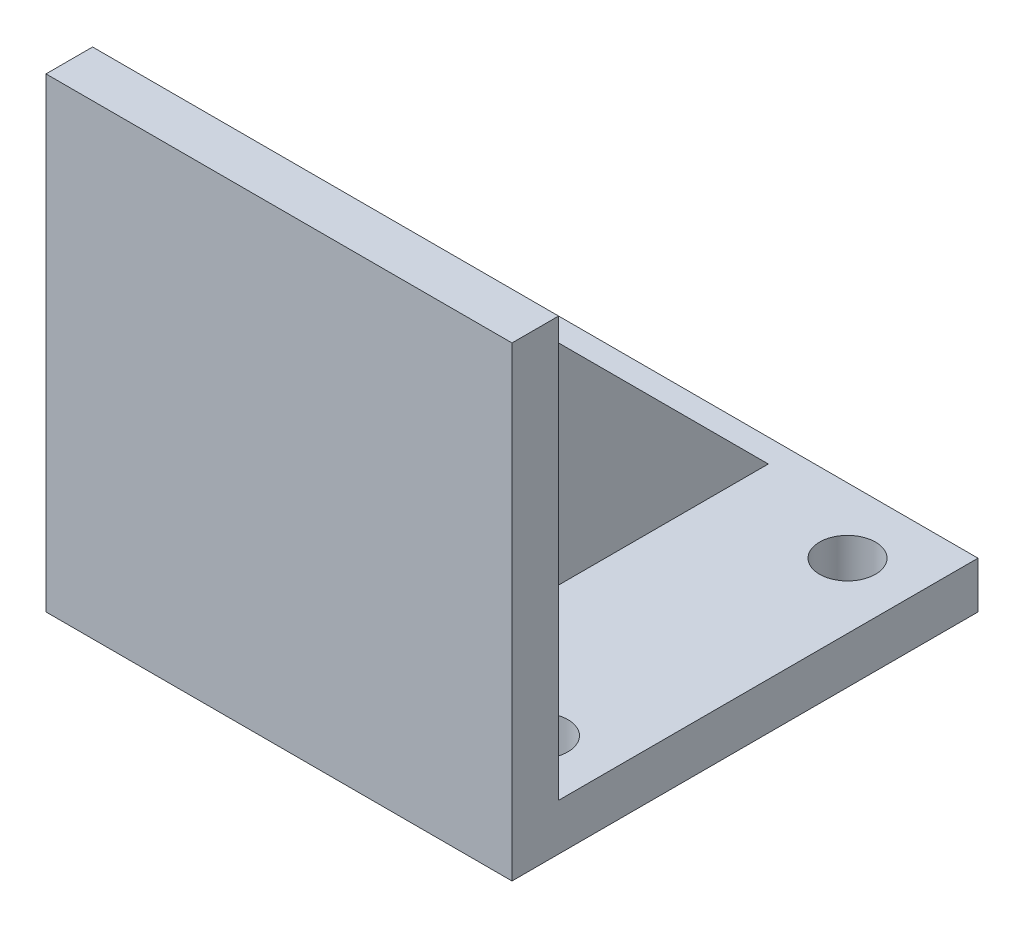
from build123d import *

# Parameters (mm, degrees)
EXTRUIR1_DEPTH  = 100
CROQUIS3_R      = 6
EXTRUIR3_DEPTH  = 100
NERVIO1_REACH   = 152
CROQUIS4_WALL_W = 436.350288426
CROQUIS4_WALL_H = 20
CROQUIS5_R      = 6
EXTRUIR4_DEPTH  = 100


with BuildPart() as part:
    # Croquis1 → Extruir1 (new body)
    with BuildSketch(Plane(origin=(0, 0, 0), x_dir=(0, 0, -1), z_dir=(1, 0, 0))):
        Polygon((0, 0), (0, 100), (10, 100), (10, 10), (100, 10), (100, 0), align=None)
    extrude(amount=EXTRUIR1_DEPTH)

    # Croquis3 → Extruir3 (cut)
    with BuildSketch(Plane(origin=(0, 10, 0), x_dir=(-1, 0, 0), z_dir=(0, 1, 0))):
        with Locations(Location((-86, -86, 0), (0, 0, 90))):
            Circle(CROQUIS3_R)
        with Locations(Location((-14, -86, 0), (0, 0, 90))):
            Circle(CROQUIS3_R)
    extrude(amount=-EXTRUIR3_DEPTH, mode=Mode.SUBTRACT)

    # Croquis4 wall → Nervio1 (add, up to next)
    with BuildSketch(Plane(origin=(50, 52.5, -52.5), x_dir=(0, -0.707106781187, -0.707106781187), z_dir=(0, 0.707106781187, -0.707106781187)), mode=Mode.PRIVATE) as nervio1_sk1:
        Rectangle(CROQUIS4_WALL_W, CROQUIS4_WALL_H)
    nervio1_tool1 = extrude(nervio1_sk1.sketch, amount=-NERVIO1_REACH, mode=Mode.PRIVATE) - part.part
    add(nervio1_tool1.solids().sort_by_distance((50, 52.5, -52.5))[0])

    # Croquis5 → Extruir4 (cut)
    with BuildSketch(Plane(origin=(0, 10, 0), x_dir=(1, 0, 0), z_dir=(0, 1, 0))):
        with Locations(Location((14, 20, 0), (0, 0, 270))):
            Circle(CROQUIS5_R)
        with Locations(Location((86, 20, 0), (0, 0, 270))):
            Circle(CROQUIS5_R)
    extrude(amount=-EXTRUIR4_DEPTH, mode=Mode.SUBTRACT)


solid = part.part
